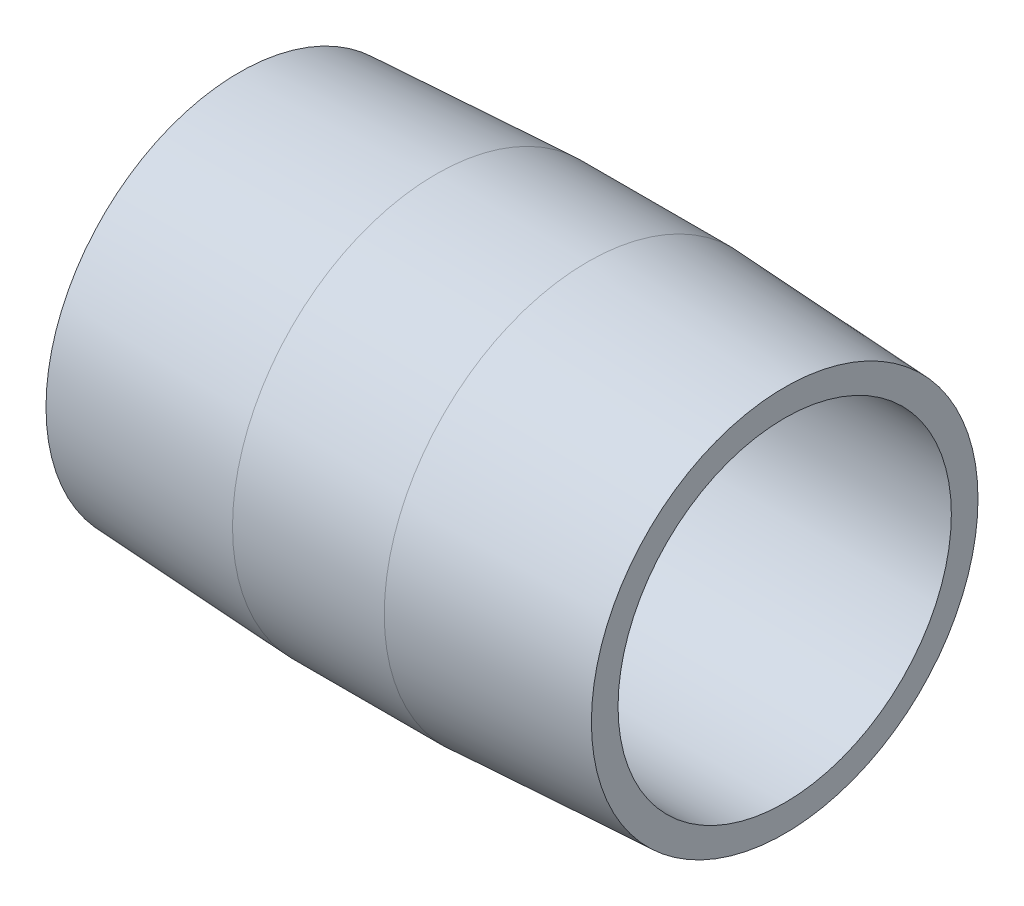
ISO-10303-21;
HEADER;
FILE_DESCRIPTION(('STEP AP214'),'2;1');
FILE_NAME('part.step','',(''),(''),'','','');
FILE_SCHEMA(('AUTOMOTIVE_DESIGN { 1 0 10303 214 1 1 1 1 }'));
ENDSEC;
DATA;
#1=APPLICATION_CONTEXT('core data for automotive mechanical design processes');
#2=APPLICATION_PROTOCOL_DEFINITION('international standard','automotive_design',2000,#1);
#3=PRODUCT_CONTEXT('',#1,'mechanical');
#4=PRODUCT('Part','Part','',(#3));
#5=PRODUCT_RELATED_PRODUCT_CATEGORY('part','',(#4));
#6=PRODUCT_DEFINITION_FORMATION('','',#4);
#7=PRODUCT_DEFINITION_CONTEXT('part definition',#1,'design');
#8=PRODUCT_DEFINITION('design','',#6,#7);
#9=PRODUCT_DEFINITION_SHAPE('','',#8);
#10=(LENGTH_UNIT() NAMED_UNIT(*) SI_UNIT(.MILLI.,.METRE.));
#11=(NAMED_UNIT(*) PLANE_ANGLE_UNIT() SI_UNIT($,.RADIAN.));
#12=(NAMED_UNIT(*) SI_UNIT($,.STERADIAN.) SOLID_ANGLE_UNIT());
#13=UNCERTAINTY_MEASURE_WITH_UNIT(LENGTH_MEASURE(1.E-05),#10,'distance_accuracy_value','');
#14=(GEOMETRIC_REPRESENTATION_CONTEXT(3) GLOBAL_UNCERTAINTY_ASSIGNED_CONTEXT((#13)) GLOBAL_UNIT_ASSIGNED_CONTEXT((#10,
#11,#12)) REPRESENTATION_CONTEXT('',''));
#15=CARTESIAN_POINT('',(0.,0.,0.));
#16=DIRECTION('',(0.,0.,1.));
#17=DIRECTION('',(1.,0.,0.));
#18=AXIS2_PLACEMENT_3D('',#15,#16,#17);
#19=CARTESIAN_POINT('',(28.575,8.73125,0.));
#20=DIRECTION('',(-1.,0.,0.));
#21=DIRECTION('',(0.,0.,1.));
#22=AXIS2_PLACEMENT_3D('',#19,#20,#21);
#23=PLANE('',#22);
#24=CARTESIAN_POINT('',(28.575,0.,0.));
#25=DIRECTION('',(-1.,0.,0.));
#26=DIRECTION('',(0.,0.,1.));
#27=AXIS2_PLACEMENT_3D('',#24,#25,#26);
#28=CIRCLE('',#27,10.1275500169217);
#29=CARTESIAN_POINT('',(28.575,0.,10.1275500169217));
#30=VERTEX_POINT('',#29);
#31=EDGE_CURVE('E10',#30,#30,#28,.T.);
#32=ORIENTED_EDGE('',*,*,#31,.F.);
#33=EDGE_LOOP('',(#32));
#34=FACE_BOUND('',#33,.T.);
#35=CARTESIAN_POINT('',(28.575,0.,0.));
#36=DIRECTION('',(-1.,0.,0.));
#37=DIRECTION('',(0.,0.,1.));
#38=AXIS2_PLACEMENT_3D('',#35,#36,#37);
#39=CIRCLE('',#38,8.73125);
#40=CARTESIAN_POINT('',(28.575,0.,8.73125));
#41=VERTEX_POINT('',#40);
#42=EDGE_CURVE('E52',#41,#41,#39,.T.);
#43=ORIENTED_EDGE('',*,*,#42,.T.);
#44=EDGE_LOOP('',(#43));
#45=FACE_BOUND('',#44,.T.);
#46=ADVANCED_FACE('F30',(#34,#45),#23,.F.);
#47=CARTESIAN_POINT('',(28.575,0.,0.));
#48=DIRECTION('',(-1.,0.,0.));
#49=DIRECTION('',(0.,0.,1.));
#50=AXIS2_PLACEMENT_3D('',#47,#48,#49);
#51=CONICAL_SURFACE('',#50,10.1275500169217,0.052359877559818);
#52=CARTESIAN_POINT('',(18.2626,0.,0.));
#53=DIRECTION('',(-1.,0.,0.));
#54=DIRECTION('',(0.,0.,1.));
#55=AXIS2_PLACEMENT_3D('',#52,#53,#54);
#56=CIRCLE('',#55,10.668);
#57=CARTESIAN_POINT('',(18.2626,0.,10.668));
#58=VERTEX_POINT('',#57);
#59=EDGE_CURVE('E36',#58,#58,#56,.T.);
#60=ORIENTED_EDGE('',*,*,#59,.F.);
#61=EDGE_LOOP('',(#60));
#62=FACE_BOUND('',#61,.T.);
#63=ORIENTED_EDGE('',*,*,#31,.T.);
#64=EDGE_LOOP('',(#63));
#65=FACE_BOUND('',#64,.T.);
#66=ADVANCED_FACE('F77',(#62,#65),#51,.T.);
#67=CARTESIAN_POINT('',(0.,0.,0.));
#68=DIRECTION('',(-1.,0.,0.));
#69=DIRECTION('',(0.,0.,1.));
#70=AXIS2_PLACEMENT_3D('',#67,#68,#69);
#71=CYLINDRICAL_SURFACE('',#70,10.668);
#72=CARTESIAN_POINT('',(10.3124,0.,0.));
#73=DIRECTION('',(-1.,0.,0.));
#74=DIRECTION('',(0.,0.,1.));
#75=AXIS2_PLACEMENT_3D('',#72,#73,#74);
#76=CIRCLE('',#75,10.668);
#77=CARTESIAN_POINT('',(10.3124,0.,10.668));
#78=VERTEX_POINT('',#77);
#79=EDGE_CURVE('E40',#78,#78,#76,.T.);
#80=ORIENTED_EDGE('',*,*,#79,.F.);
#81=EDGE_LOOP('',(#80));
#82=FACE_BOUND('',#81,.T.);
#83=ORIENTED_EDGE('',*,*,#59,.T.);
#84=EDGE_LOOP('',(#83));
#85=FACE_BOUND('',#84,.T.);
#86=ADVANCED_FACE('F72',(#82,#85),#71,.T.);
#87=CARTESIAN_POINT('',(10.3124,0.,0.));
#88=DIRECTION('',(1.,0.,0.));
#89=DIRECTION('',(0.,0.,-1.));
#90=AXIS2_PLACEMENT_3D('',#87,#88,#89);
#91=CONICAL_SURFACE('',#90,10.668,0.0523598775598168);
#92=CARTESIAN_POINT('',(0.,0.,0.));
#93=DIRECTION('',(-1.,0.,0.));
#94=DIRECTION('',(0.,0.,1.));
#95=AXIS2_PLACEMENT_3D('',#92,#93,#94);
#96=CIRCLE('',#95,10.1275500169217);
#97=CARTESIAN_POINT('',(0.,0.,10.1275500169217));
#98=VERTEX_POINT('',#97);
#99=EDGE_CURVE('E44',#98,#98,#96,.T.);
#100=ORIENTED_EDGE('',*,*,#99,.F.);
#101=EDGE_LOOP('',(#100));
#102=FACE_BOUND('',#101,.T.);
#103=ORIENTED_EDGE('',*,*,#79,.T.);
#104=EDGE_LOOP('',(#103));
#105=FACE_BOUND('',#104,.T.);
#106=ADVANCED_FACE('F66',(#102,#105),#91,.T.);
#107=CARTESIAN_POINT('',(0.,10.1275500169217,0.));
#108=DIRECTION('',(1.,0.,0.));
#109=DIRECTION('',(0.,0.,-1.));
#110=AXIS2_PLACEMENT_3D('',#107,#108,#109);
#111=PLANE('',#110);
#112=CARTESIAN_POINT('',(0.,0.,0.));
#113=DIRECTION('',(-1.,0.,0.));
#114=DIRECTION('',(0.,0.,1.));
#115=AXIS2_PLACEMENT_3D('',#112,#113,#114);
#116=CIRCLE('',#115,8.73125);
#117=CARTESIAN_POINT('',(0.,0.,8.73125));
#118=VERTEX_POINT('',#117);
#119=EDGE_CURVE('E49',#118,#118,#116,.T.);
#120=ORIENTED_EDGE('',*,*,#119,.F.);
#121=EDGE_LOOP('',(#120));
#122=FACE_BOUND('',#121,.T.);
#123=ORIENTED_EDGE('',*,*,#99,.T.);
#124=EDGE_LOOP('',(#123));
#125=FACE_BOUND('',#124,.T.);
#126=ADVANCED_FACE('F60',(#122,#125),#111,.F.);
#127=CARTESIAN_POINT('',(0.,0.,0.));
#128=DIRECTION('',(-1.,0.,0.));
#129=DIRECTION('',(0.,0.,1.));
#130=AXIS2_PLACEMENT_3D('',#127,#128,#129);
#131=CYLINDRICAL_SURFACE('',#130,8.73125);
#132=ORIENTED_EDGE('',*,*,#42,.F.);
#133=EDGE_LOOP('',(#132));
#134=FACE_BOUND('',#133,.T.);
#135=ORIENTED_EDGE('',*,*,#119,.T.);
#136=EDGE_LOOP('',(#135));
#137=FACE_BOUND('',#136,.T.);
#138=ADVANCED_FACE('F57',(#134,#137),#131,.F.);
#139=CLOSED_SHELL('',(#46,#66,#86,#106,#126,#138));
#140=MANIFOLD_SOLID_BREP('B2',#139);
#141=ADVANCED_BREP_SHAPE_REPRESENTATION('',(#18,#140),#14);
#142=SHAPE_DEFINITION_REPRESENTATION(#9,#141);
ENDSEC;
END-ISO-10303-21;
